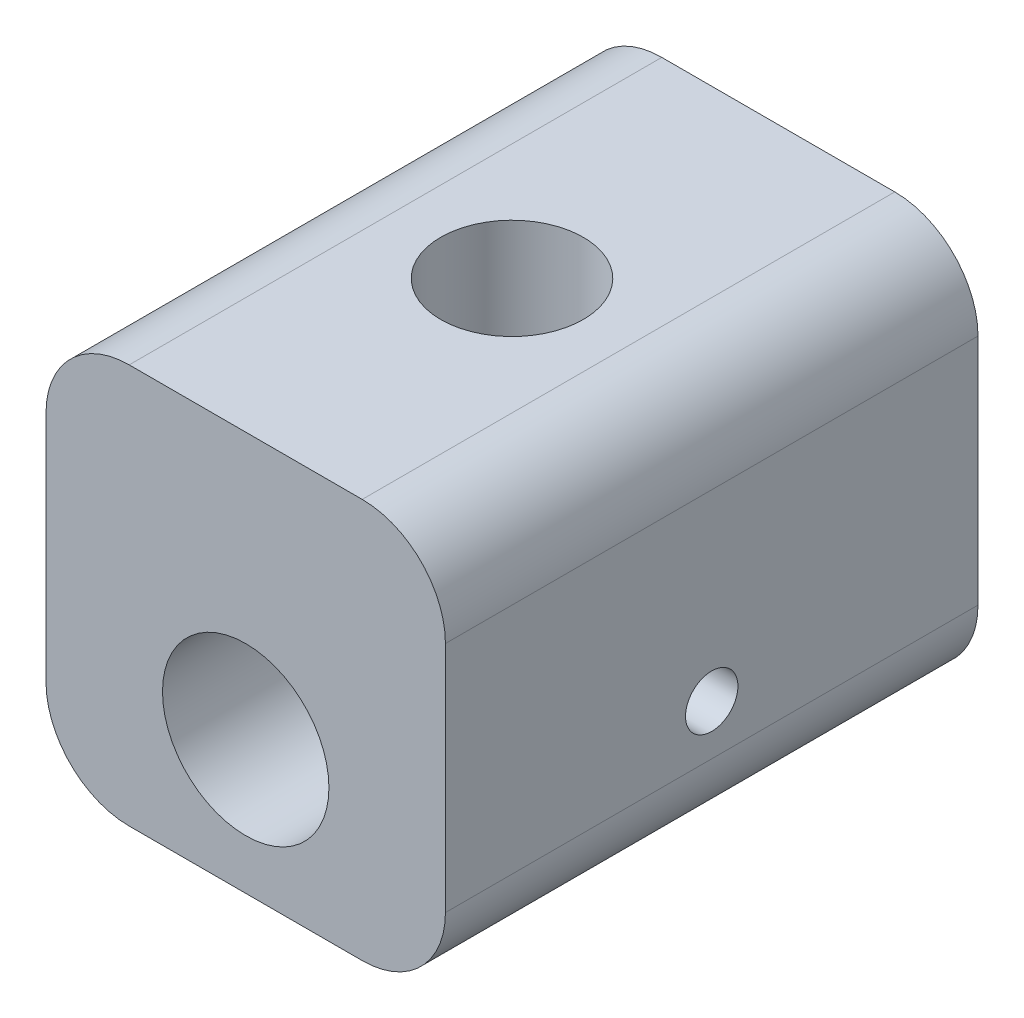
from build123d import *

# Parameters (mm, degrees)
SKETCH1_W                         = 19.05
SKETCH1_H                         = 19.05
SKETCH1_R                         = 3.96875
BOSS_EXTRUDE1_DEPTH               = 25.4
FILLET1_R                         = 3.96875
TAP_DRILL_FOR_M8X1_25_TAP1_REACH  = 35.148
TAP_DRILL_FOR_M8X1_25_TAP1_BORE_R = 3.4
TAP_DRILL_FOR_M3X0_5_TAP1_REACH   = 36.196
TAP_DRILL_FOR_M3X0_5_TAP1_BORE_R  = 1.25


with BuildPart() as part:
    # Sketch1 → Boss-Extrude1 (new body)
    with BuildSketch(Plane.XY):
        with Locations((0, 3.175)):
            Rectangle(SKETCH1_W, SKETCH1_H)
        Circle(SKETCH1_R, mode=Mode.SUBTRACT)
    extrude(amount=BOSS_EXTRUDE1_DEPTH)

    # Fillet1
    fillet1_edges = [part.edges().sort_by_distance(p)[0] for p in [
        (-9.525, 12.7, 12.7),
        (9.525, 12.7, 12.7),
        (9.525, -6.35, 12.7),
        (-9.525, -6.35, 12.7),
    ]]
    fillet(fillet1_edges, radius=FILLET1_R)

    # Tap Drill for M8x1.25 Tap1 bore → Tap Drill for M8x1.25 Tap1 (cut, up to next)
    with BuildSketch(Plane(origin=(0, 12.7, 0), x_dir=(1, 0, 0), z_dir=(0, 1, 0)), mode=Mode.PRIVATE) as tap_drill_for_m8x1_25_tap1_sk1:
        with Locations((0, -12.7)):
            Circle(TAP_DRILL_FOR_M8X1_25_TAP1_BORE_R)
    tap_drill_for_m8x1_25_tap1_tool1 = extrude(tap_drill_for_m8x1_25_tap1_sk1.sketch, amount=-TAP_DRILL_FOR_M8X1_25_TAP1_REACH, mode=Mode.PRIVATE) & part.part
    add(tap_drill_for_m8x1_25_tap1_tool1.solids().sort_by_distance((0, 12.7, 12.7))[0], mode=Mode.SUBTRACT)

    # Tap Drill for M3x0.5 Tap1 bore → Tap Drill for M3x0.5 Tap1 (cut, up to next)
    with BuildSketch(Plane(origin=(9.525, 0, 0), x_dir=(0, 0, -1), z_dir=(1, 0, 0)), mode=Mode.PRIVATE) as tap_drill_for_m3x0_5_tap1_sk1:
        with Locations((-12.7, 0)):
            Circle(TAP_DRILL_FOR_M3X0_5_TAP1_BORE_R)
    tap_drill_for_m3x0_5_tap1_tool1 = extrude(tap_drill_for_m3x0_5_tap1_sk1.sketch, amount=-TAP_DRILL_FOR_M3X0_5_TAP1_REACH, mode=Mode.PRIVATE) & part.part
    add(tap_drill_for_m3x0_5_tap1_tool1.solids().sort_by_distance((9.525, 0, 12.7))[0], mode=Mode.SUBTRACT)


solid = part.part
